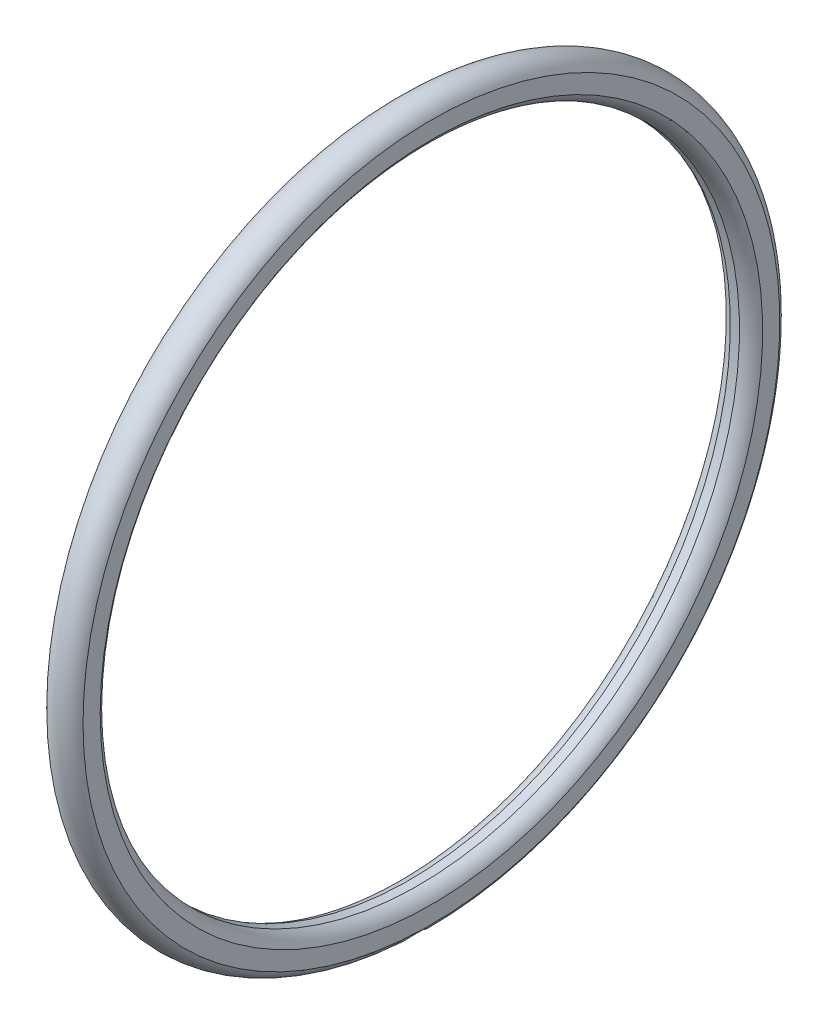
ISO-10303-21;
HEADER;
FILE_DESCRIPTION(('STEP AP214'),'2;1');
FILE_NAME('part.step','',(''),(''),'','','');
FILE_SCHEMA(('AUTOMOTIVE_DESIGN { 1 0 10303 214 1 1 1 1 }'));
ENDSEC;
DATA;
#1=APPLICATION_CONTEXT('core data for automotive mechanical design processes');
#2=APPLICATION_PROTOCOL_DEFINITION('international standard','automotive_design',2000,#1);
#3=PRODUCT_CONTEXT('',#1,'mechanical');
#4=PRODUCT('Part','Part','',(#3));
#5=PRODUCT_RELATED_PRODUCT_CATEGORY('part','',(#4));
#6=PRODUCT_DEFINITION_FORMATION('','',#4);
#7=PRODUCT_DEFINITION_CONTEXT('part definition',#1,'design');
#8=PRODUCT_DEFINITION('design','',#6,#7);
#9=PRODUCT_DEFINITION_SHAPE('','',#8);
#10=(LENGTH_UNIT() NAMED_UNIT(*) SI_UNIT(.MILLI.,.METRE.));
#11=(NAMED_UNIT(*) PLANE_ANGLE_UNIT() SI_UNIT($,.RADIAN.));
#12=(NAMED_UNIT(*) SI_UNIT($,.STERADIAN.) SOLID_ANGLE_UNIT());
#13=UNCERTAINTY_MEASURE_WITH_UNIT(LENGTH_MEASURE(1.E-05),#10,'distance_accuracy_value','');
#14=(GEOMETRIC_REPRESENTATION_CONTEXT(3) GLOBAL_UNCERTAINTY_ASSIGNED_CONTEXT((#13)) GLOBAL_UNIT_ASSIGNED_CONTEXT((#10,
#11,#12)) REPRESENTATION_CONTEXT('',''));
#15=CARTESIAN_POINT('',(0.,0.,0.));
#16=DIRECTION('',(0.,0.,1.));
#17=DIRECTION('',(1.,0.,0.));
#18=AXIS2_PLACEMENT_3D('',#15,#16,#17);
#19=CARTESIAN_POINT('',(0.,0.,0.));
#20=DIRECTION('',(-1.,0.,0.));
#21=DIRECTION('',(0.,0.,1.));
#22=AXIS2_PLACEMENT_3D('',#19,#20,#21);
#23=TOROIDAL_SURFACE('',#22,46.775,2.675);
#24=CARTESIAN_POINT('',(-0.628987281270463,0.,0.));
#25=DIRECTION('',(-1.,0.,0.));
#26=DIRECTION('',(0.,0.,1.));
#27=AXIS2_PLACEMENT_3D('',#24,#25,#26);
#28=CIRCLE('',#27,44.175);
#29=CARTESIAN_POINT('',(-0.628987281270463,0.,44.175));
#30=VERTEX_POINT('',#29);
#31=EDGE_CURVE('E10',#30,#30,#28,.T.);
#32=ORIENTED_EDGE('',*,*,#31,.F.);
#33=EDGE_LOOP('',(#32));
#34=FACE_BOUND('',#33,.T.);
#35=CARTESIAN_POINT('',(-2.6,0.,0.));
#36=DIRECTION('',(-1.,0.,0.));
#37=DIRECTION('',(0.,0.,1.));
#38=AXIS2_PLACEMENT_3D('',#35,#36,#37);
#39=CIRCLE('',#38,46.1460127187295);
#40=CARTESIAN_POINT('',(-2.6,0.,46.1460127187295));
#41=VERTEX_POINT('',#40);
#42=EDGE_CURVE('E51',#41,#41,#39,.T.);
#43=ORIENTED_EDGE('',*,*,#42,.T.);
#44=EDGE_LOOP('',(#43));
#45=FACE_BOUND('',#44,.T.);
#46=ADVANCED_FACE('F29',(#34,#45),#23,.T.);
#47=CARTESIAN_POINT('',(-19.552102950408,0.,0.));
#48=DIRECTION('',(-1.,0.,0.));
#49=DIRECTION('',(0.,0.,1.));
#50=AXIS2_PLACEMENT_3D('',#47,#48,#49);
#51=CYLINDRICAL_SURFACE('',#50,44.175);
#52=CARTESIAN_POINT('',(0.628987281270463,0.,0.));
#53=DIRECTION('',(-1.,0.,0.));
#54=DIRECTION('',(0.,0.,1.));
#55=AXIS2_PLACEMENT_3D('',#52,#53,#54);
#56=CIRCLE('',#55,44.175);
#57=CARTESIAN_POINT('',(0.628987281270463,0.,44.175));
#58=VERTEX_POINT('',#57);
#59=EDGE_CURVE('E35',#58,#58,#56,.T.);
#60=ORIENTED_EDGE('',*,*,#59,.F.);
#61=EDGE_LOOP('',(#60));
#62=FACE_BOUND('',#61,.T.);
#63=ORIENTED_EDGE('',*,*,#31,.T.);
#64=EDGE_LOOP('',(#63));
#65=FACE_BOUND('',#64,.T.);
#66=ADVANCED_FACE('F76',(#62,#65),#51,.F.);
#67=CARTESIAN_POINT('',(0.,0.,0.));
#68=DIRECTION('',(-1.,0.,0.));
#69=DIRECTION('',(0.,0.,1.));
#70=AXIS2_PLACEMENT_3D('',#67,#68,#69);
#71=TOROIDAL_SURFACE('',#70,46.775,2.675);
#72=CARTESIAN_POINT('',(2.4,0.,0.));
#73=DIRECTION('',(-1.,0.,0.));
#74=DIRECTION('',(0.,0.,1.));
#75=AXIS2_PLACEMENT_3D('',#72,#73,#74);
#76=CIRCLE('',#75,45.5936342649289);
#77=CARTESIAN_POINT('',(2.4,0.,45.5936342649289));
#78=VERTEX_POINT('',#77);
#79=EDGE_CURVE('E39',#78,#78,#76,.T.);
#80=ORIENTED_EDGE('',*,*,#79,.F.);
#81=EDGE_LOOP('',(#80));
#82=FACE_BOUND('',#81,.T.);
#83=ORIENTED_EDGE('',*,*,#59,.T.);
#84=EDGE_LOOP('',(#83));
#85=FACE_BOUND('',#84,.T.);
#86=ADVANCED_FACE('F71',(#82,#85),#71,.T.);
#87=CARTESIAN_POINT('',(2.4,47.9563657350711,0.));
#88=DIRECTION('',(-1.,0.,0.));
#89=DIRECTION('',(0.,0.,1.));
#90=AXIS2_PLACEMENT_3D('',#87,#88,#89);
#91=PLANE('',#90);
#92=CARTESIAN_POINT('',(2.4,0.,0.));
#93=DIRECTION('',(-1.,0.,0.));
#94=DIRECTION('',(0.,0.,1.));
#95=AXIS2_PLACEMENT_3D('',#92,#93,#94);
#96=CIRCLE('',#95,47.9563657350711);
#97=CARTESIAN_POINT('',(2.4,0.,47.9563657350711));
#98=VERTEX_POINT('',#97);
#99=EDGE_CURVE('E43',#98,#98,#96,.T.);
#100=ORIENTED_EDGE('',*,*,#99,.F.);
#101=EDGE_LOOP('',(#100));
#102=FACE_BOUND('',#101,.T.);
#103=ORIENTED_EDGE('',*,*,#79,.T.);
#104=EDGE_LOOP('',(#103));
#105=FACE_BOUND('',#104,.T.);
#106=ADVANCED_FACE('F65',(#102,#105),#91,.F.);
#107=CARTESIAN_POINT('',(0.,0.,0.));
#108=DIRECTION('',(-1.,0.,0.));
#109=DIRECTION('',(0.,0.,1.));
#110=AXIS2_PLACEMENT_3D('',#107,#108,#109);
#111=TOROIDAL_SURFACE('',#110,46.775,2.675);
#112=CARTESIAN_POINT('',(-2.6,0.,0.));
#113=DIRECTION('',(-1.,0.,0.));
#114=DIRECTION('',(0.,0.,1.));
#115=AXIS2_PLACEMENT_3D('',#112,#113,#114);
#116=CIRCLE('',#115,47.4039872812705);
#117=CARTESIAN_POINT('',(-2.6,0.,47.4039872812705));
#118=VERTEX_POINT('',#117);
#119=EDGE_CURVE('E48',#118,#118,#116,.T.);
#120=ORIENTED_EDGE('',*,*,#119,.F.);
#121=EDGE_LOOP('',(#120));
#122=FACE_BOUND('',#121,.T.);
#123=ORIENTED_EDGE('',*,*,#99,.T.);
#124=EDGE_LOOP('',(#123));
#125=FACE_BOUND('',#124,.T.);
#126=ADVANCED_FACE('F59',(#122,#125),#111,.T.);
#127=CARTESIAN_POINT('',(-2.6,47.4039872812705,0.));
#128=DIRECTION('',(1.,0.,0.));
#129=DIRECTION('',(0.,0.,-1.));
#130=AXIS2_PLACEMENT_3D('',#127,#128,#129);
#131=PLANE('',#130);
#132=ORIENTED_EDGE('',*,*,#42,.F.);
#133=EDGE_LOOP('',(#132));
#134=FACE_BOUND('',#133,.T.);
#135=ORIENTED_EDGE('',*,*,#119,.T.);
#136=EDGE_LOOP('',(#135));
#137=FACE_BOUND('',#136,.T.);
#138=ADVANCED_FACE('F56',(#134,#137),#131,.F.);
#139=CLOSED_SHELL('',(#46,#66,#86,#106,#126,#138));
#140=MANIFOLD_SOLID_BREP('B2',#139);
#141=ADVANCED_BREP_SHAPE_REPRESENTATION('',(#18,#140),#14);
#142=SHAPE_DEFINITION_REPRESENTATION(#9,#141);
ENDSEC;
END-ISO-10303-21;
